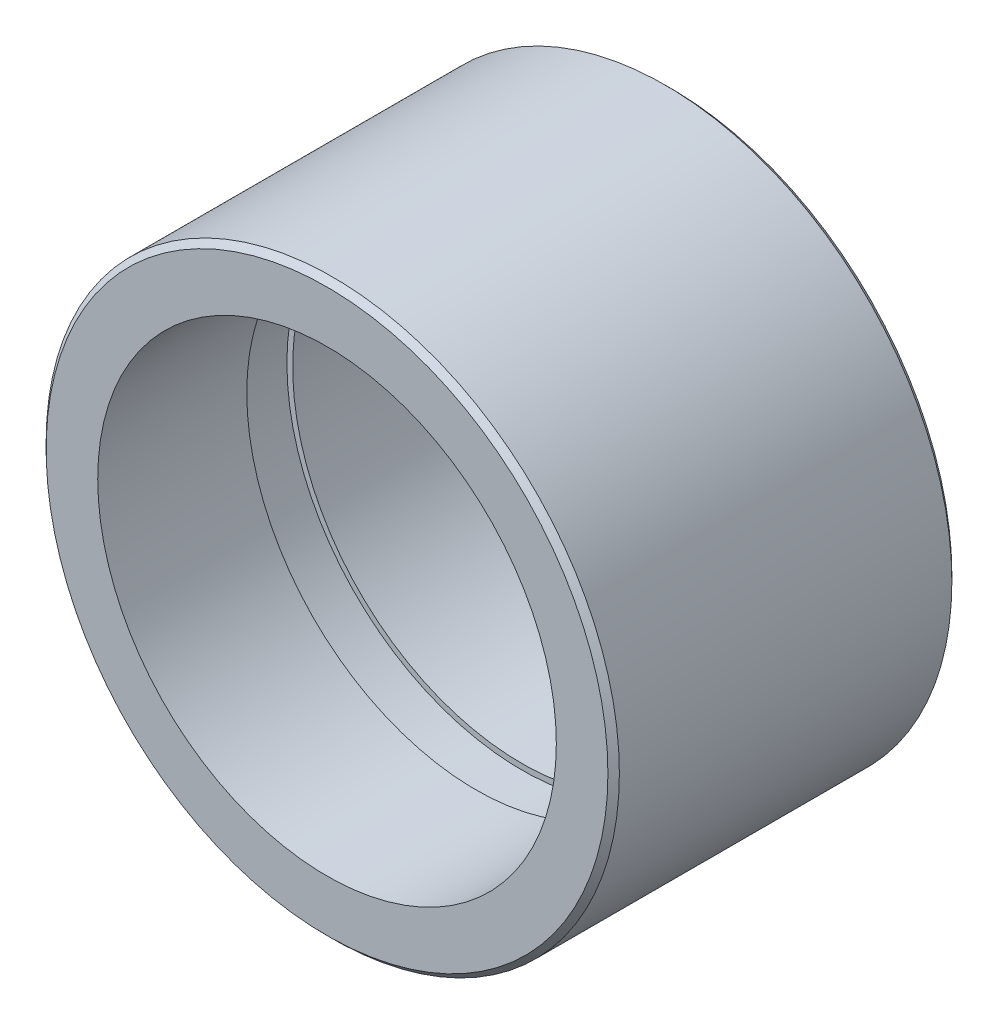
ISO-10303-21;
HEADER;
FILE_DESCRIPTION(('STEP AP214'),'2;1');
FILE_NAME('part.step','',(''),(''),'','','');
FILE_SCHEMA(('AUTOMOTIVE_DESIGN { 1 0 10303 214 1 1 1 1 }'));
ENDSEC;
DATA;
#1=APPLICATION_CONTEXT('core data for automotive mechanical design processes');
#2=APPLICATION_PROTOCOL_DEFINITION('international standard','automotive_design',2000,#1);
#3=PRODUCT_CONTEXT('',#1,'mechanical');
#4=PRODUCT('Part','Part','',(#3));
#5=PRODUCT_RELATED_PRODUCT_CATEGORY('part','',(#4));
#6=PRODUCT_DEFINITION_FORMATION('','',#4);
#7=PRODUCT_DEFINITION_CONTEXT('part definition',#1,'design');
#8=PRODUCT_DEFINITION('design','',#6,#7);
#9=PRODUCT_DEFINITION_SHAPE('','',#8);
#10=(LENGTH_UNIT() NAMED_UNIT(*) SI_UNIT(.MILLI.,.METRE.));
#11=(NAMED_UNIT(*) PLANE_ANGLE_UNIT() SI_UNIT($,.RADIAN.));
#12=(NAMED_UNIT(*) SI_UNIT($,.STERADIAN.) SOLID_ANGLE_UNIT());
#13=UNCERTAINTY_MEASURE_WITH_UNIT(LENGTH_MEASURE(1.E-05),#10,'distance_accuracy_value','');
#14=(GEOMETRIC_REPRESENTATION_CONTEXT(3) GLOBAL_UNCERTAINTY_ASSIGNED_CONTEXT((#13)) GLOBAL_UNIT_ASSIGNED_CONTEXT((#10,
#11,#12)) REPRESENTATION_CONTEXT('',''));
#15=CARTESIAN_POINT('',(0.,0.,0.));
#16=DIRECTION('',(0.,0.,1.));
#17=DIRECTION('',(1.,0.,0.));
#18=AXIS2_PLACEMENT_3D('',#15,#16,#17);
#19=CARTESIAN_POINT('',(0.,0.,60.));
#20=DIRECTION('',(0.,0.,-1.));
#21=DIRECTION('',(-1.,0.,0.));
#22=AXIS2_PLACEMENT_3D('',#19,#20,#21);
#23=CYLINDRICAL_SURFACE('',#22,40.);
#24=CARTESIAN_POINT('',(0.,0.,60.));
#25=DIRECTION('',(0.,0.,1.));
#26=DIRECTION('',(1.,0.,0.));
#27=AXIS2_PLACEMENT_3D('',#24,#25,#26);
#28=CIRCLE('',#27,40.);
#29=CARTESIAN_POINT('',(40.,0.,60.));
#30=VERTEX_POINT('',#29);
#31=EDGE_CURVE('E50',#30,#30,#28,.T.);
#32=ORIENTED_EDGE('',*,*,#31,.T.);
#33=EDGE_LOOP('',(#32));
#34=FACE_BOUND('',#33,.T.);
#35=CARTESIAN_POINT('',(0.,0.,34.));
#36=DIRECTION('',(0.,0.,-1.));
#37=DIRECTION('',(-1.,0.,0.));
#38=AXIS2_PLACEMENT_3D('',#35,#36,#37);
#39=CIRCLE('',#38,40.);
#40=CARTESIAN_POINT('',(-40.,0.,34.));
#41=VERTEX_POINT('',#40);
#42=EDGE_CURVE('E51',#41,#41,#39,.T.);
#43=ORIENTED_EDGE('',*,*,#42,.T.);
#44=EDGE_LOOP('',(#43));
#45=FACE_BOUND('',#44,.T.);
#46=ADVANCED_FACE('F30',(#34,#45),#23,.F.);
#47=CARTESIAN_POINT('',(0.,0.,0.));
#48=DIRECTION('',(0.,0.,1.));
#49=DIRECTION('',(1.,0.,0.));
#50=AXIS2_PLACEMENT_3D('',#47,#48,#49);
#51=CIRCLE('',#50,40.);
#52=CARTESIAN_POINT('',(40.,0.,0.));
#53=VERTEX_POINT('',#52);
#54=EDGE_CURVE('E54',#53,#53,#51,.T.);
#55=ORIENTED_EDGE('',*,*,#54,.F.);
#56=EDGE_LOOP('',(#55));
#57=FACE_BOUND('',#56,.T.);
#58=CARTESIAN_POINT('',(0.,0.,26.));
#59=DIRECTION('',(0.,0.,1.));
#60=DIRECTION('',(1.,0.,0.));
#61=AXIS2_PLACEMENT_3D('',#58,#59,#60);
#62=CIRCLE('',#61,40.);
#63=CARTESIAN_POINT('',(40.,0.,26.));
#64=VERTEX_POINT('',#63);
#65=EDGE_CURVE('E55',#64,#64,#62,.T.);
#66=ORIENTED_EDGE('',*,*,#65,.T.);
#67=EDGE_LOOP('',(#66));
#68=FACE_BOUND('',#67,.T.);
#69=ADVANCED_FACE('F87',(#57,#68),#23,.F.);
#70=CARTESIAN_POINT('',(0.,0.,60.));
#71=DIRECTION('',(0.,0.,1.));
#72=DIRECTION('',(1.,0.,0.));
#73=AXIS2_PLACEMENT_3D('',#70,#71,#72);
#74=PLANE('',#73);
#75=CARTESIAN_POINT('',(0.,0.,60.));
#76=DIRECTION('',(0.,0.,1.));
#77=DIRECTION('',(1.,0.,0.));
#78=AXIS2_PLACEMENT_3D('',#75,#76,#77);
#79=CIRCLE('',#78,49.);
#80=CARTESIAN_POINT('',(49.,0.,60.));
#81=VERTEX_POINT('',#80);
#82=EDGE_CURVE('E45',#81,#81,#79,.T.);
#83=ORIENTED_EDGE('',*,*,#82,.T.);
#84=EDGE_LOOP('',(#83));
#85=FACE_BOUND('',#84,.T.);
#86=ORIENTED_EDGE('',*,*,#31,.F.);
#87=EDGE_LOOP('',(#86));
#88=FACE_BOUND('',#87,.T.);
#89=ADVANCED_FACE('F92',(#85,#88),#74,.T.);
#90=CARTESIAN_POINT('',(0.,0.,0.));
#91=DIRECTION('',(0.,0.,1.));
#92=DIRECTION('',(1.,0.,0.));
#93=AXIS2_PLACEMENT_3D('',#90,#91,#92);
#94=PLANE('',#93);
#95=CARTESIAN_POINT('',(0.,0.,0.));
#96=DIRECTION('',(0.,0.,1.));
#97=DIRECTION('',(1.,0.,0.));
#98=AXIS2_PLACEMENT_3D('',#95,#96,#97);
#99=CIRCLE('',#98,49.);
#100=CARTESIAN_POINT('',(49.,0.,0.));
#101=VERTEX_POINT('',#100);
#102=EDGE_CURVE('E10',#101,#101,#99,.F.);
#103=ORIENTED_EDGE('',*,*,#102,.T.);
#104=EDGE_LOOP('',(#103));
#105=FACE_BOUND('',#104,.T.);
#106=ORIENTED_EDGE('',*,*,#54,.T.);
#107=EDGE_LOOP('',(#106));
#108=FACE_BOUND('',#107,.T.);
#109=ADVANCED_FACE('F83',(#105,#108),#94,.F.);
#110=CARTESIAN_POINT('',(0.,0.,60.));
#111=DIRECTION('',(0.,0.,-1.));
#112=DIRECTION('',(-1.,0.,0.));
#113=AXIS2_PLACEMENT_3D('',#110,#111,#112);
#114=CYLINDRICAL_SURFACE('',#113,50.);
#115=CARTESIAN_POINT('',(0.,0.,59.));
#116=DIRECTION('',(0.,0.,1.));
#117=DIRECTION('',(1.,0.,0.));
#118=AXIS2_PLACEMENT_3D('',#115,#116,#117);
#119=CIRCLE('',#118,50.);
#120=CARTESIAN_POINT('',(50.,0.,59.));
#121=VERTEX_POINT('',#120);
#122=EDGE_CURVE('E37',#121,#121,#119,.F.);
#123=ORIENTED_EDGE('',*,*,#122,.T.);
#124=EDGE_LOOP('',(#123));
#125=FACE_BOUND('',#124,.T.);
#126=CARTESIAN_POINT('',(0.,0.,1.00000000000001));
#127=DIRECTION('',(0.,0.,1.));
#128=DIRECTION('',(1.,0.,0.));
#129=AXIS2_PLACEMENT_3D('',#126,#127,#128);
#130=CIRCLE('',#129,50.);
#131=CARTESIAN_POINT('',(50.,0.,1.00000000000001));
#132=VERTEX_POINT('',#131);
#133=EDGE_CURVE('E41',#132,#132,#130,.T.);
#134=ORIENTED_EDGE('',*,*,#133,.T.);
#135=EDGE_LOOP('',(#134));
#136=FACE_BOUND('',#135,.T.);
#137=ADVANCED_FACE('F32',(#125,#136),#114,.T.);
#138=CARTESIAN_POINT('',(0.,41.,34.));
#139=DIRECTION('',(0.,0.,-1.));
#140=DIRECTION('',(-1.,0.,0.));
#141=AXIS2_PLACEMENT_3D('',#138,#139,#140);
#142=PLANE('',#141);
#143=ORIENTED_EDGE('',*,*,#42,.F.);
#144=EDGE_LOOP('',(#143));
#145=FACE_BOUND('',#144,.T.);
#146=CARTESIAN_POINT('',(0.,0.,34.));
#147=DIRECTION('',(0.,0.,1.));
#148=DIRECTION('',(1.,0.,0.));
#149=AXIS2_PLACEMENT_3D('',#146,#147,#148);
#150=CIRCLE('',#149,41.);
#151=CARTESIAN_POINT('',(41.,0.,34.));
#152=VERTEX_POINT('',#151);
#153=EDGE_CURVE('E65',#152,#152,#150,.T.);
#154=ORIENTED_EDGE('',*,*,#153,.F.);
#155=EDGE_LOOP('',(#154));
#156=FACE_BOUND('',#155,.T.);
#157=ADVANCED_FACE('F72',(#145,#156),#142,.T.);
#158=CARTESIAN_POINT('',(0.,41.,26.));
#159=DIRECTION('',(0.,0.,1.));
#160=DIRECTION('',(1.,0.,0.));
#161=AXIS2_PLACEMENT_3D('',#158,#159,#160);
#162=PLANE('',#161);
#163=ORIENTED_EDGE('',*,*,#65,.F.);
#164=EDGE_LOOP('',(#163));
#165=FACE_BOUND('',#164,.T.);
#166=CARTESIAN_POINT('',(0.,0.,26.));
#167=DIRECTION('',(0.,0.,1.));
#168=DIRECTION('',(1.,0.,0.));
#169=AXIS2_PLACEMENT_3D('',#166,#167,#168);
#170=CIRCLE('',#169,41.);
#171=CARTESIAN_POINT('',(41.,0.,26.));
#172=VERTEX_POINT('',#171);
#173=EDGE_CURVE('E58',#172,#172,#170,.T.);
#174=ORIENTED_EDGE('',*,*,#173,.T.);
#175=EDGE_LOOP('',(#174));
#176=FACE_BOUND('',#175,.T.);
#177=ADVANCED_FACE('F74',(#165,#176),#162,.T.);
#178=CARTESIAN_POINT('',(0.,0.,60.));
#179=DIRECTION('',(0.,0.,1.));
#180=DIRECTION('',(1.,0.,0.));
#181=AXIS2_PLACEMENT_3D('',#178,#179,#180);
#182=CYLINDRICAL_SURFACE('',#181,41.);
#183=ORIENTED_EDGE('',*,*,#153,.T.);
#184=EDGE_LOOP('',(#183));
#185=FACE_BOUND('',#184,.T.);
#186=ORIENTED_EDGE('',*,*,#173,.F.);
#187=EDGE_LOOP('',(#186));
#188=FACE_BOUND('',#187,.T.);
#189=ADVANCED_FACE('F69',(#185,#188),#182,.F.);
#190=CARTESIAN_POINT('',(0.,0.,60.));
#191=DIRECTION('',(0.,0.,-1.));
#192=DIRECTION('',(-1.,0.,0.));
#193=AXIS2_PLACEMENT_3D('',#190,#191,#192);
#194=CONICAL_SURFACE('',#193,49.,0.785398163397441);
#195=ORIENTED_EDGE('',*,*,#122,.F.);
#196=EDGE_LOOP('',(#195));
#197=FACE_BOUND('',#196,.T.);
#198=ORIENTED_EDGE('',*,*,#82,.F.);
#199=EDGE_LOOP('',(#198));
#200=FACE_BOUND('',#199,.T.);
#201=ADVANCED_FACE('F105',(#197,#200),#194,.T.);
#202=CARTESIAN_POINT('',(0.,0.,1.00000000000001));
#203=DIRECTION('',(0.,0.,1.));
#204=DIRECTION('',(1.,0.,0.));
#205=AXIS2_PLACEMENT_3D('',#202,#203,#204);
#206=CONICAL_SURFACE('',#205,50.,0.785398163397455);
#207=ORIENTED_EDGE('',*,*,#102,.F.);
#208=EDGE_LOOP('',(#207));
#209=FACE_BOUND('',#208,.T.);
#210=ORIENTED_EDGE('',*,*,#133,.F.);
#211=EDGE_LOOP('',(#210));
#212=FACE_BOUND('',#211,.T.);
#213=ADVANCED_FACE('F107',(#209,#212),#206,.T.);
#214=CLOSED_SHELL('',(#46,#69,#89,#109,#137,#157,#177,#189,#201,#213));
#215=MANIFOLD_SOLID_BREP('B2',#214);
#216=ADVANCED_BREP_SHAPE_REPRESENTATION('',(#18,#215),#14);
#217=SHAPE_DEFINITION_REPRESENTATION(#9,#216);
ENDSEC;
END-ISO-10303-21;
